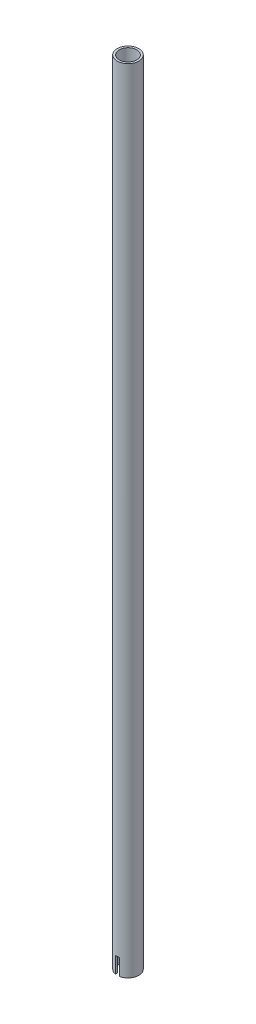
from build123d import *

# Parameters (mm, degrees)
SKETCH1_R          = 16.6624
SKETCH1_R_2        = 13.4874
EXTRUDE1_DEPTH     = 1219.2
SKETCH2_W          = 6.35
SKETCH2_H          = 334.203694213
CUT_EXTRUDE1_DEPTH = 19.05


with BuildPart() as part:
    # Sketch1 → Extrude1 (new body)
    with BuildSketch(Plane(origin=(0, 0, 0), x_dir=(1, 0, 0), z_dir=(0, 1, 0))):
        with Locations(Location((0, 0, 0), (0, 0, 270))):
            Circle(SKETCH1_R)
        with Locations(Location((0, 0, 0), (0, 0, 270))):
            Circle(SKETCH1_R_2, mode=Mode.SUBTRACT)
    extrude(amount=-EXTRUDE1_DEPTH)

    # Sketch2 → Cut-Extrude1 (cut, symmetric)
    with BuildSketch(Plane.XY):
        with Locations((0, -1360.901847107)):
            Rectangle(SKETCH2_W, SKETCH2_H)
    extrude(amount=CUT_EXTRUDE1_DEPTH, both=True, mode=Mode.SUBTRACT)


solid = part.part
